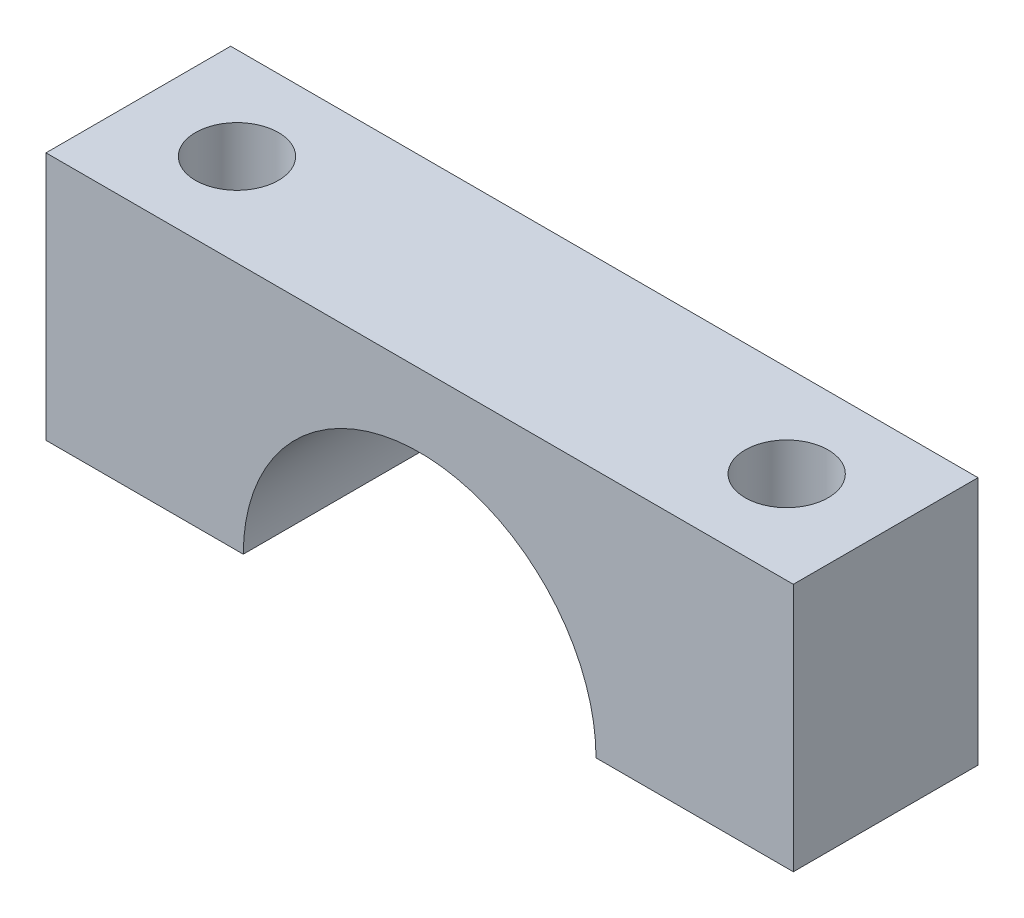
from build123d import *

# Parameters (mm, degrees)
EXTRUSION1_DEPTH                                   = 44.5
CHAMBRAGE_POUR_VIS_T_TE_HEXAGONALE_M81_D           = 9
CHAMBRAGE_POUR_VIS_T_TE_HEXAGONALE_M81_CBORE_D     = 20
CHAMBRAGE_POUR_VIS_T_TE_HEXAGONALE_M81_CBORE_DEPTH = 18
R_P_TITION_LIN_AIRE1_COUNT                         = 2
R_P_TITION_LIN_AIRE1_PITCH                         = 132.46
ENL_V_MAT_EXTRU_1_DEPTH                            = 5
ENL_V_MAT_EXTRU_1_DEPTH_BACK                       = 5


with BuildPart() as part:
    # Esquisse2 → Extrusion1 (new body)
    with BuildSketch(Plane.XY):
        with BuildLine():
            Line((0, 0), (0, 60))
            Line((0, 60), (180.08, 60))
            Line((180.08, 60), (180.08, 0))
            Line((180.08, 0), (132.54, 0))
            ThreePointArc((132.54, 0), (90.04, 42.5), (47.54, 0))
            Line((47.54, 0), (0, 0))
        make_face()
    extrude(amount=EXTRUSION1_DEPTH)

    # Chambrage pour vis _ t_te hexagonale M81 (through all)
    with Locations(Plane(origin=(0, 60, 0), x_dir=(-1, 0, 0), z_dir=(0, 1, 0))):
        with Locations((-23.77, 22.25)):
            chambrage_pour_vis_t_te_hexagonale_m81 = CounterBoreHole(CHAMBRAGE_POUR_VIS_T_TE_HEXAGONALE_M81_D / 2, CHAMBRAGE_POUR_VIS_T_TE_HEXAGONALE_M81_CBORE_D / 2, CHAMBRAGE_POUR_VIS_T_TE_HEXAGONALE_M81_CBORE_DEPTH)

    # R_p_tition lin_aire1: Chambrage pour vis _ t_te hexagonale M81 ×2
    with Locations(*[(i * R_P_TITION_LIN_AIRE1_PITCH, 0, 0) for i in range(1, R_P_TITION_LIN_AIRE1_COUNT)]):
        add(chambrage_pour_vis_t_te_hexagonale_m81, mode=Mode.SUBTRACT)

    # Esquisse6 → Enl_v. mat.-Extru.1 (cut, two sides: drawn at the far end of the back side and taken through both)
    with BuildSketch(Plane.XY.offset(22.25).offset(-ENL_V_MAT_EXTRU_1_DEPTH_BACK)):
        with BuildLine():
            Line((71.444796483, 39.87754263), (72.078723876, 38.518080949))
            ThreePointArc((72.078723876, 38.518080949), (90.04, 42.5), (108.001276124, 38.518080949))
            Line((108.001276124, 38.518080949), (108.635203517, 39.87754263))
            ThreePointArc((108.635203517, 39.87754263), (90.04, 44), (71.444796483, 39.87754263))
        make_face()
    extrude(amount=ENL_V_MAT_EXTRU_1_DEPTH + ENL_V_MAT_EXTRU_1_DEPTH_BACK, mode=Mode.SUBTRACT)


solid = part.part
